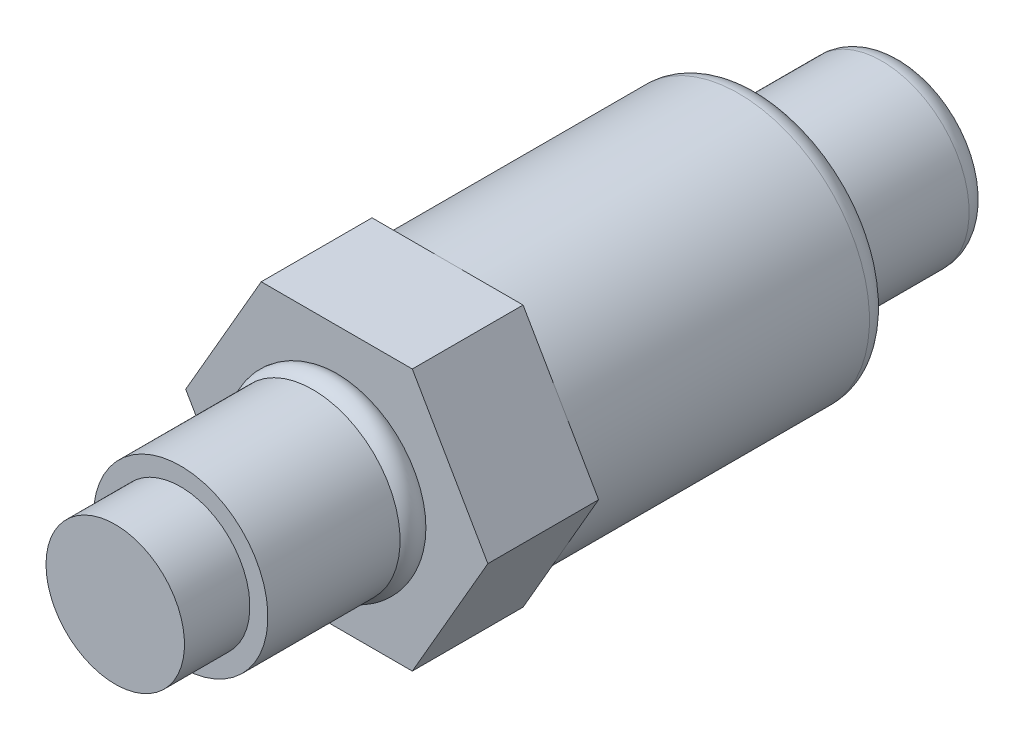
from build123d import *

# Parameters (mm, degrees)
BOSS_EXTRUDE1_DEPTH = 5.08
FILLET1_R           = 1


with BuildPart() as part:
    # Sketch1 → Boss-Extrude1 (new body)
    with BuildSketch(Plane.XY.offset(19.43)):
        Polygon((6.92820323, 0), (3.464101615, 6), (-3.464101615, 6), (-6.92820323, 0), (-3.464101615, -6), (3.464101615, -6), align=None)
    extrude(amount=-BOSS_EXTRUDE1_DEPTH)

    # Sketch2 → Revolve1 (revolve)
    with BuildSketch(Plane.XZ, mode=Mode.PRIVATE) as revolve1_sk:
        Polygon((6, 14.35), (0, 14.35), (0, -6.57), (4, -6.57), (4, 0), (6, 0), align=None)
    revolve(revolve1_sk.sketch.rotate(Axis((0, 0, 14.35), (0, 0, -1)), 180), axis=Axis((0, 0, 14.35), (0, 0, -1)))

    # Sketch3 → Revolve2 (revolve)
    with BuildSketch(Plane.XZ, mode=Mode.PRIVATE) as revolve2_sk:
        with BuildLine():
            Line((3.175, 29.59), (0, 29.59))
            Line((0, 29.59), (0, 19.43))
            Line((0, 19.43), (4.088603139, 19.43))
            ThreePointArc((4.088603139, 19.43), (4.257353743, 19.995623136), (4, 20.526824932))
            Line((4, 20.526824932), (4, 26.59))
            Line((4, 26.59), (3.175, 26.59))
            Line((3.175, 26.59), (3.175, 29.59))
        make_face()
    revolve(revolve2_sk.sketch.rotate(Axis((0, 0, 29.59), (0, 0, -1)), 180), axis=Axis((0, 0, 29.59), (0, 0, -1)))

    # Fillet1
    fillet1_edges = [part.edges().sort_by_distance(p)[0] for p in [
        (4, 0, -6.57),
        (6, 0, 0),
    ]]
    fillet(fillet1_edges, radius=FILLET1_R)


solid = part.part
